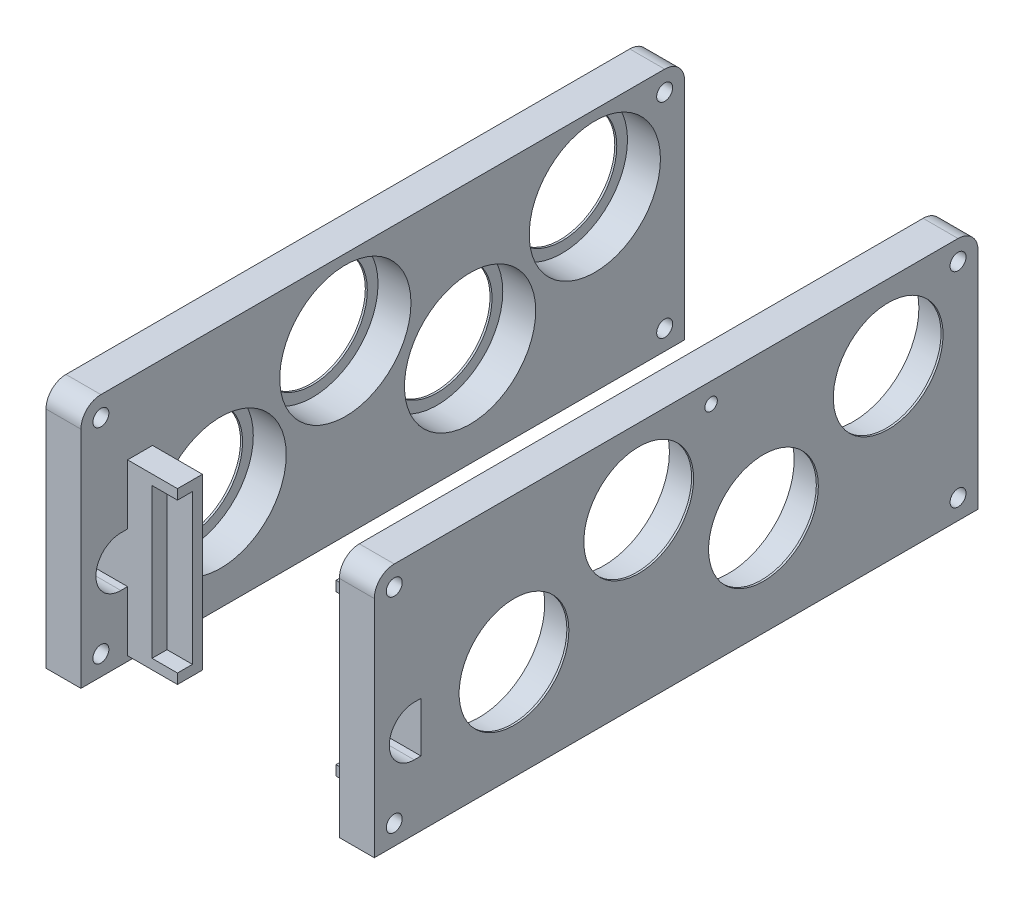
from build123d import *

# Parameters (mm, degrees)
SKETCH1_W           = 121
SKETCH1_H           = 49
SKETCH1_R           = 13.15
BOSS_EXTRUDE1_DEPTH = 7
SKETCH2_W           = 121
SKETCH2_H           = 49
SKETCH2_R           = 11
BOSS_EXTRUDE2_DEPTH = 0.4
BOSS_EXTRUDE3_DEPTH = 10
SKETCH4_W           = 3
SKETCH4_H           = 30
BOSS_EXTRUDE4_DEPTH = 4.9
CUT_EXTRUDE1_DEPTH  = 131.927460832
FILLET1_R           = 4
SKETCH7_R           = 1.6
SKETCH7_R_2         = 1.25
CUT_EXTRUDE2_DEPTH  = 132.647255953
BOSS_EXTRUDE5_START = -0.5
SKETCH8_R           = 1.25
BOSS_EXTRUDE5_DEPTH = 0.5


with BuildPart() as part:
    # Sketch1 → Boss-Extrude1 (new body)
    with BuildSketch(Plane(origin=(0, 0, 0), x_dir=(0, 0, -1), z_dir=(1, 0, 0))):
        with Locations((60.5, 24.5)):
            Rectangle(SKETCH1_W, SKETCH1_H)
        with Locations((28, 20)):
            Circle(SKETCH1_R, mode=Mode.SUBTRACT)
        with Locations((78, 20)):
            Circle(SKETCH1_R, mode=Mode.SUBTRACT)
        with Locations((53, 33.85)):
            Circle(SKETCH1_R, mode=Mode.SUBTRACT)
        with Locations((103, 33.85)):
            Circle(SKETCH1_R, mode=Mode.SUBTRACT)
    extrude(amount=BOSS_EXTRUDE1_DEPTH)

    # Sketch2 → Boss-Extrude2 (add)
    with BuildSketch(Plane(origin=(7, 0, 0), x_dir=(0, 0, -1), z_dir=(1, 0, 0))):
        with Locations((60.5, 24.5)):
            Rectangle(SKETCH2_W, SKETCH2_H)
        with Locations((28, 20)):
            Circle(SKETCH2_R, mode=Mode.SUBTRACT)
        with Locations((53, 33.85)):
            Circle(SKETCH2_R, mode=Mode.SUBTRACT)
        with Locations((78, 20)):
            Circle(SKETCH2_R, mode=Mode.SUBTRACT)
        with Locations((103, 33.85)):
            Circle(SKETCH2_R, mode=Mode.SUBTRACT)
    extrude(amount=-BOSS_EXTRUDE2_DEPTH)

    # Sketch3 → Boss-Extrude3 (add)
    with BuildSketch(Plane.ZY):
        Polygon((-9.35, 3), (-12.35, 3), (-12.35, 33), (-9.35, 33), (-9.35, 35), (-14.35, 35), (-14.35, 1), (-9.35, 1), align=None)
    extrude(amount=BOSS_EXTRUDE3_DEPTH)

    # Sketch4 → Boss-Extrude4 (add)
    with BuildSketch(Plane.ZY):
        with Locations((-10.85, 18)):
            Rectangle(SKETCH4_W, SKETCH4_H)
    extrude(amount=BOSS_EXTRUDE4_DEPTH)

    # Sketch5 → Cut-Extrude1 (cut, through all)
    with BuildSketch(Plane.ZY):
        with BuildLine():
            Line((-9.35, 23), (-8, 23))
            ThreePointArc((-8, 23), (-3, 18), (-8, 13))
            Line((-8, 13), (-9.35, 13))
            Line((-9.35, 13), (-9.35, 23))
        make_face()
    extrude(amount=-CUT_EXTRUDE1_DEPTH, mode=Mode.SUBTRACT)

    # Fillet1
    fillet1_edges = [part.edges().sort_by_distance(p)[0] for p in [
        (3.5, 49, 0),
        (3.5, 49, -121),
    ]]
    fillet(fillet1_edges, radius=FILLET1_R)

    # Sketch7 → Cut-Extrude2 (cut, through all)
    with BuildSketch(Plane(origin=(7, 0, 0), x_dir=(0, 0, -1), z_dir=(1, 0, 0))):
        with Locations((4, 45)):
            Circle(SKETCH7_R)
        with Locations((117, 45)):
            Circle(SKETCH7_R)
        with Locations((67.5, 45)):
            Circle(SKETCH7_R_2)
        with Locations(Location((117, 4, 0), (0, 0, 180))):
            Circle(SKETCH7_R)
        with Locations(Location((4, 4, 0), (0, 0, 180))):
            Circle(SKETCH7_R)
    extrude(amount=-CUT_EXTRUDE2_DEPTH, mode=Mode.SUBTRACT)

    # Sketch8 → Boss-Extrude5 (add)
    with BuildSketch(Plane.ZY.offset(BOSS_EXTRUDE5_START)):
        with Locations(Location((-67.5, 45, 0), (0, 0, 180))):
            Circle(SKETCH8_R)
    extrude(amount=BOSS_EXTRUDE5_DEPTH)


with BuildPart() as body_2:
    # Mirror2: mirrored copy
    add(part.part.mirror(Plane.ZY.offset(25.9)))


solid = Compound([part.part, body_2.part])
